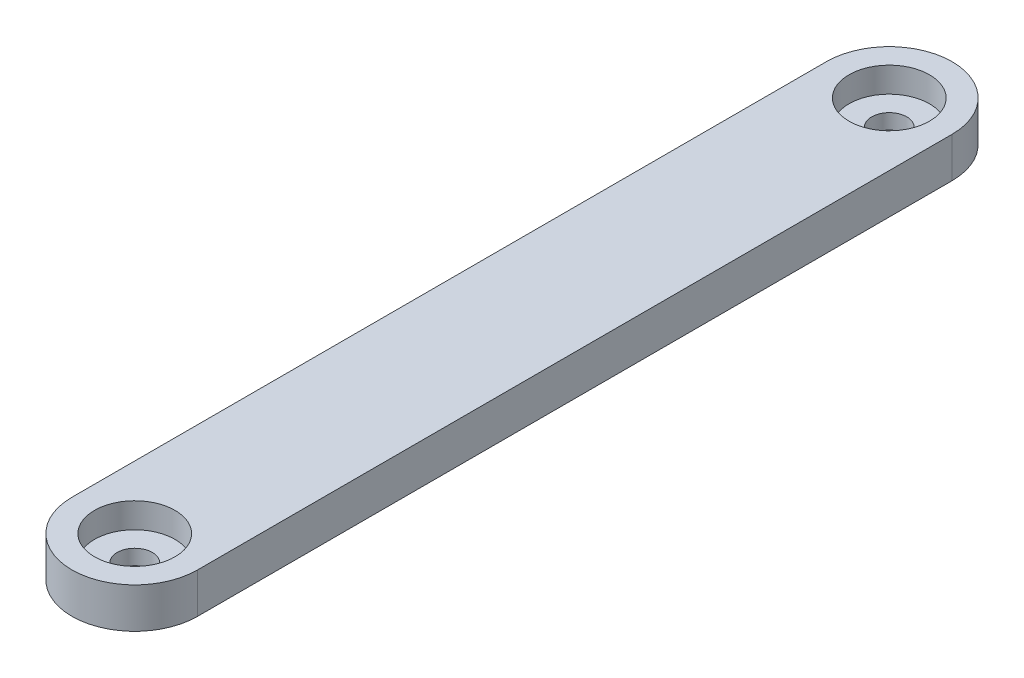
ISO-10303-21;
HEADER;
FILE_DESCRIPTION(('STEP AP214'),'2;1');
FILE_NAME('part.step','',(''),(''),'','','');
FILE_SCHEMA(('AUTOMOTIVE_DESIGN { 1 0 10303 214 1 1 1 1 }'));
ENDSEC;
DATA;
#1=APPLICATION_CONTEXT('core data for automotive mechanical design processes');
#2=APPLICATION_PROTOCOL_DEFINITION('international standard','automotive_design',2000,#1);
#3=PRODUCT_CONTEXT('',#1,'mechanical');
#4=PRODUCT('Part','Part','',(#3));
#5=PRODUCT_RELATED_PRODUCT_CATEGORY('part','',(#4));
#6=PRODUCT_DEFINITION_FORMATION('','',#4);
#7=PRODUCT_DEFINITION_CONTEXT('part definition',#1,'design');
#8=PRODUCT_DEFINITION('design','',#6,#7);
#9=PRODUCT_DEFINITION_SHAPE('','',#8);
#10=(LENGTH_UNIT() NAMED_UNIT(*) SI_UNIT(.MILLI.,.METRE.));
#11=(NAMED_UNIT(*) PLANE_ANGLE_UNIT() SI_UNIT($,.RADIAN.));
#12=(NAMED_UNIT(*) SI_UNIT($,.STERADIAN.) SOLID_ANGLE_UNIT());
#13=UNCERTAINTY_MEASURE_WITH_UNIT(LENGTH_MEASURE(1.E-05),#10,'distance_accuracy_value','');
#14=(GEOMETRIC_REPRESENTATION_CONTEXT(3) GLOBAL_UNCERTAINTY_ASSIGNED_CONTEXT((#13)) GLOBAL_UNIT_ASSIGNED_CONTEXT((#10,
#11,#12)) REPRESENTATION_CONTEXT('',''));
#15=CARTESIAN_POINT('',(0.,0.,0.));
#16=DIRECTION('',(0.,0.,1.));
#17=DIRECTION('',(1.,0.,0.));
#18=AXIS2_PLACEMENT_3D('',#15,#16,#17);
#19=CARTESIAN_POINT('',(0.,8.,0.));
#20=DIRECTION('',(0.,-1.,0.));
#21=DIRECTION('',(0.,0.,-1.));
#22=AXIS2_PLACEMENT_3D('',#19,#20,#21);
#23=CYLINDRICAL_SURFACE('',#22,12.5);
#24=CARTESIAN_POINT('',(0.,0.,0.));
#25=DIRECTION('',(0.,1.,0.));
#26=DIRECTION('',(0.,0.,1.));
#27=AXIS2_PLACEMENT_3D('',#24,#25,#26);
#28=CIRCLE('',#27,12.5);
#29=CARTESIAN_POINT('',(12.5,0.,0.));
#30=VERTEX_POINT('',#29);
#31=CARTESIAN_POINT('',(-12.5,0.,0.));
#32=VERTEX_POINT('',#31);
#33=EDGE_CURVE('E112',#30,#32,#28,.T.);
#34=ORIENTED_EDGE('',*,*,#33,.T.);
#35=DIRECTION('',(0.,-1.,0.));
#36=VECTOR('',#35,1.);
#37=CARTESIAN_POINT('',(-12.5,8.,0.));
#38=LINE('',#37,#36);
#39=CARTESIAN_POINT('',(-12.5,8.,0.));
#40=VERTEX_POINT('',#39);
#41=EDGE_CURVE('E11',#40,#32,#38,.T.);
#42=ORIENTED_EDGE('',*,*,#41,.F.);
#43=CARTESIAN_POINT('',(0.,8.,0.));
#44=DIRECTION('',(0.,1.,0.));
#45=DIRECTION('',(0.,0.,1.));
#46=AXIS2_PLACEMENT_3D('',#43,#44,#45);
#47=CIRCLE('',#46,12.5);
#48=CARTESIAN_POINT('',(12.5,8.,0.));
#49=VERTEX_POINT('',#48);
#50=EDGE_CURVE('E95',#49,#40,#47,.T.);
#51=ORIENTED_EDGE('',*,*,#50,.F.);
#52=DIRECTION('',(0.,-1.,0.));
#53=VECTOR('',#52,1.);
#54=CARTESIAN_POINT('',(12.5,8.,0.));
#55=LINE('',#54,#53);
#56=EDGE_CURVE('E108',#49,#30,#55,.T.);
#57=ORIENTED_EDGE('',*,*,#56,.T.);
#58=EDGE_LOOP('',(#34,#42,#51,#57));
#59=FACE_BOUND('',#58,.T.);
#60=ADVANCED_FACE('F41',(#59),#23,.T.);
#61=CARTESIAN_POINT('',(-12.5,8.,0.));
#62=DIRECTION('',(1.,0.,0.));
#63=DIRECTION('',(0.,0.,-1.));
#64=AXIS2_PLACEMENT_3D('',#61,#62,#63);
#65=PLANE('',#64);
#66=DIRECTION('',(0.,0.,1.));
#67=VECTOR('',#66,1.);
#68=CARTESIAN_POINT('',(-12.5,0.,0.));
#69=LINE('',#68,#67);
#70=CARTESIAN_POINT('',(-12.5,0.,150.));
#71=VERTEX_POINT('',#70);
#72=EDGE_CURVE('E100',#32,#71,#69,.T.);
#73=ORIENTED_EDGE('',*,*,#72,.T.);
#74=DIRECTION('',(0.,-1.,0.));
#75=VECTOR('',#74,1.);
#76=CARTESIAN_POINT('',(-12.5,8.,150.));
#77=LINE('',#76,#75);
#78=CARTESIAN_POINT('',(-12.5,8.,150.));
#79=VERTEX_POINT('',#78);
#80=EDGE_CURVE('E51',#79,#71,#77,.T.);
#81=ORIENTED_EDGE('',*,*,#80,.F.);
#82=DIRECTION('',(0.,0.,1.));
#83=VECTOR('',#82,1.);
#84=CARTESIAN_POINT('',(-12.5,8.,0.));
#85=LINE('',#84,#83);
#86=EDGE_CURVE('E90',#40,#79,#85,.T.);
#87=ORIENTED_EDGE('',*,*,#86,.F.);
#88=ORIENTED_EDGE('',*,*,#41,.T.);
#89=EDGE_LOOP('',(#73,#81,#87,#88));
#90=FACE_BOUND('',#89,.T.);
#91=ADVANCED_FACE('F99',(#90),#65,.F.);
#92=CARTESIAN_POINT('',(0.,8.,150.));
#93=DIRECTION('',(0.,-1.,0.));
#94=DIRECTION('',(0.,0.,-1.));
#95=AXIS2_PLACEMENT_3D('',#92,#93,#94);
#96=CYLINDRICAL_SURFACE('',#95,12.5);
#97=CARTESIAN_POINT('',(0.,0.,150.));
#98=DIRECTION('',(0.,1.,0.));
#99=DIRECTION('',(0.,0.,1.));
#100=AXIS2_PLACEMENT_3D('',#97,#98,#99);
#101=CIRCLE('',#100,12.5);
#102=CARTESIAN_POINT('',(12.5,0.,150.));
#103=VERTEX_POINT('',#102);
#104=EDGE_CURVE('E77',#71,#103,#101,.T.);
#105=ORIENTED_EDGE('',*,*,#104,.T.);
#106=DIRECTION('',(0.,-1.,0.));
#107=VECTOR('',#106,1.);
#108=CARTESIAN_POINT('',(12.5,8.,150.));
#109=LINE('',#108,#107);
#110=CARTESIAN_POINT('',(12.5,8.,150.));
#111=VERTEX_POINT('',#110);
#112=EDGE_CURVE('E102',#111,#103,#109,.T.);
#113=ORIENTED_EDGE('',*,*,#112,.F.);
#114=CARTESIAN_POINT('',(0.,8.,150.));
#115=DIRECTION('',(0.,1.,0.));
#116=DIRECTION('',(0.,0.,1.));
#117=AXIS2_PLACEMENT_3D('',#114,#115,#116);
#118=CIRCLE('',#117,12.5);
#119=EDGE_CURVE('E93',#79,#111,#118,.T.);
#120=ORIENTED_EDGE('',*,*,#119,.F.);
#121=ORIENTED_EDGE('',*,*,#80,.T.);
#122=EDGE_LOOP('',(#105,#113,#120,#121));
#123=FACE_BOUND('',#122,.T.);
#124=ADVANCED_FACE('F104',(#123),#96,.T.);
#125=CARTESIAN_POINT('',(12.5,8.,0.));
#126=DIRECTION('',(-1.,0.,0.));
#127=DIRECTION('',(0.,0.,1.));
#128=AXIS2_PLACEMENT_3D('',#125,#126,#127);
#129=PLANE('',#128);
#130=DIRECTION('',(0.,0.,-1.));
#131=VECTOR('',#130,1.);
#132=CARTESIAN_POINT('',(12.5,0.,0.));
#133=LINE('',#132,#131);
#134=EDGE_CURVE('E83',#103,#30,#133,.T.);
#135=ORIENTED_EDGE('',*,*,#134,.T.);
#136=ORIENTED_EDGE('',*,*,#56,.F.);
#137=DIRECTION('',(0.,0.,-1.));
#138=VECTOR('',#137,1.);
#139=CARTESIAN_POINT('',(12.5,8.,0.));
#140=LINE('',#139,#138);
#141=EDGE_CURVE('E60',#111,#49,#140,.T.);
#142=ORIENTED_EDGE('',*,*,#141,.F.);
#143=ORIENTED_EDGE('',*,*,#112,.T.);
#144=EDGE_LOOP('',(#135,#136,#142,#143));
#145=FACE_BOUND('',#144,.T.);
#146=ADVANCED_FACE('F163',(#145),#129,.F.);
#147=CARTESIAN_POINT('',(0.,8.,0.));
#148=DIRECTION('',(0.,1.,0.));
#149=DIRECTION('',(0.,0.,1.));
#150=AXIS2_PLACEMENT_3D('',#147,#148,#149);
#151=PLANE('',#150);
#152=CARTESIAN_POINT('',(0.,8.,150.));
#153=DIRECTION('',(0.,1.,0.));
#154=DIRECTION('',(0.,0.,1.));
#155=AXIS2_PLACEMENT_3D('',#152,#153,#154);
#156=CIRCLE('',#155,8.);
#157=CARTESIAN_POINT('',(0.,8.,158.));
#158=VERTEX_POINT('',#157);
#159=EDGE_CURVE('E144',#158,#158,#156,.T.);
#160=ORIENTED_EDGE('',*,*,#159,.F.);
#161=EDGE_LOOP('',(#160));
#162=FACE_BOUND('',#161,.T.);
#163=CARTESIAN_POINT('',(0.,8.,0.));
#164=DIRECTION('',(0.,1.,0.));
#165=DIRECTION('',(0.,0.,1.));
#166=AXIS2_PLACEMENT_3D('',#163,#164,#165);
#167=CIRCLE('',#166,8.);
#168=CARTESIAN_POINT('',(0.,8.,8.));
#169=VERTEX_POINT('',#168);
#170=EDGE_CURVE('E129',#169,#169,#167,.T.);
#171=ORIENTED_EDGE('',*,*,#170,.F.);
#172=EDGE_LOOP('',(#171));
#173=FACE_BOUND('',#172,.T.);
#174=ORIENTED_EDGE('',*,*,#50,.T.);
#175=ORIENTED_EDGE('',*,*,#86,.T.);
#176=ORIENTED_EDGE('',*,*,#119,.T.);
#177=ORIENTED_EDGE('',*,*,#141,.T.);
#178=EDGE_LOOP('',(#174,#175,#176,#177));
#179=FACE_BOUND('',#178,.T.);
#180=ADVANCED_FACE('F91',(#162,#173,#179),#151,.T.);
#181=CARTESIAN_POINT('',(0.,0.,0.));
#182=DIRECTION('',(0.,1.,0.));
#183=DIRECTION('',(0.,0.,1.));
#184=AXIS2_PLACEMENT_3D('',#181,#182,#183);
#185=PLANE('',#184);
#186=CARTESIAN_POINT('',(0.,0.,150.));
#187=DIRECTION('',(0.,1.,0.));
#188=DIRECTION('',(0.,0.,1.));
#189=AXIS2_PLACEMENT_3D('',#186,#187,#188);
#190=CIRCLE('',#189,3.5);
#191=CARTESIAN_POINT('',(0.,0.,153.5));
#192=VERTEX_POINT('',#191);
#193=EDGE_CURVE('E264',#192,#192,#190,.T.);
#194=ORIENTED_EDGE('',*,*,#193,.T.);
#195=EDGE_LOOP('',(#194));
#196=FACE_BOUND('',#195,.T.);
#197=CARTESIAN_POINT('',(0.,0.,0.));
#198=DIRECTION('',(0.,1.,0.));
#199=DIRECTION('',(0.,0.,1.));
#200=AXIS2_PLACEMENT_3D('',#197,#198,#199);
#201=CIRCLE('',#200,3.5);
#202=CARTESIAN_POINT('',(0.,0.,3.5));
#203=VERTEX_POINT('',#202);
#204=EDGE_CURVE('E130',#203,#203,#201,.T.);
#205=ORIENTED_EDGE('',*,*,#204,.T.);
#206=EDGE_LOOP('',(#205));
#207=FACE_BOUND('',#206,.T.);
#208=ORIENTED_EDGE('',*,*,#33,.F.);
#209=ORIENTED_EDGE('',*,*,#134,.F.);
#210=ORIENTED_EDGE('',*,*,#104,.F.);
#211=ORIENTED_EDGE('',*,*,#72,.F.);
#212=EDGE_LOOP('',(#208,#209,#210,#211));
#213=FACE_BOUND('',#212,.T.);
#214=ADVANCED_FACE('F158',(#196,#207,#213),#185,.F.);
#215=CARTESIAN_POINT('',(0.,3.,0.));
#216=DIRECTION('',(0.,1.,0.));
#217=DIRECTION('',(0.,0.,1.));
#218=AXIS2_PLACEMENT_3D('',#215,#216,#217);
#219=CYLINDRICAL_SURFACE('',#218,8.);
#220=CARTESIAN_POINT('',(0.,3.,0.));
#221=DIRECTION('',(0.,1.,0.));
#222=DIRECTION('',(0.,0.,1.));
#223=AXIS2_PLACEMENT_3D('',#220,#221,#222);
#224=CIRCLE('',#223,8.);
#225=CARTESIAN_POINT('',(0.,3.,8.));
#226=VERTEX_POINT('',#225);
#227=EDGE_CURVE('E116',#226,#226,#224,.T.);
#228=ORIENTED_EDGE('',*,*,#227,.F.);
#229=EDGE_LOOP('',(#228));
#230=FACE_BOUND('',#229,.T.);
#231=ORIENTED_EDGE('',*,*,#170,.T.);
#232=EDGE_LOOP('',(#231));
#233=FACE_BOUND('',#232,.T.);
#234=ADVANCED_FACE('F155',(#230,#233),#219,.F.);
#235=CARTESIAN_POINT('',(0.,3.,0.));
#236=DIRECTION('',(0.,1.,0.));
#237=DIRECTION('',(0.,0.,1.));
#238=AXIS2_PLACEMENT_3D('',#235,#236,#237);
#239=PLANE('',#238);
#240=CARTESIAN_POINT('',(0.,3.,0.));
#241=DIRECTION('',(0.,1.,0.));
#242=DIRECTION('',(0.,0.,1.));
#243=AXIS2_PLACEMENT_3D('',#240,#241,#242);
#244=CIRCLE('',#243,3.5);
#245=CARTESIAN_POINT('',(0.,3.,3.5));
#246=VERTEX_POINT('',#245);
#247=EDGE_CURVE('E126',#246,#246,#244,.T.);
#248=ORIENTED_EDGE('',*,*,#247,.F.);
#249=EDGE_LOOP('',(#248));
#250=FACE_BOUND('',#249,.T.);
#251=ORIENTED_EDGE('',*,*,#227,.T.);
#252=EDGE_LOOP('',(#251));
#253=FACE_BOUND('',#252,.T.);
#254=ADVANCED_FACE('F153',(#250,#253),#239,.T.);
#255=CARTESIAN_POINT('',(0.,0.,0.));
#256=DIRECTION('',(0.,1.,0.));
#257=DIRECTION('',(0.,0.,1.));
#258=AXIS2_PLACEMENT_3D('',#255,#256,#257);
#259=CYLINDRICAL_SURFACE('',#258,3.5);
#260=ORIENTED_EDGE('',*,*,#247,.T.);
#261=EDGE_LOOP('',(#260));
#262=FACE_BOUND('',#261,.T.);
#263=ORIENTED_EDGE('',*,*,#204,.F.);
#264=EDGE_LOOP('',(#263));
#265=FACE_BOUND('',#264,.T.);
#266=ADVANCED_FACE('F208',(#262,#265),#259,.F.);
#267=CARTESIAN_POINT('',(0.,3.,150.));
#268=DIRECTION('',(0.,1.,0.));
#269=DIRECTION('',(0.,0.,1.));
#270=AXIS2_PLACEMENT_3D('',#267,#268,#269);
#271=CYLINDRICAL_SURFACE('',#270,8.);
#272=CARTESIAN_POINT('',(0.,3.,150.));
#273=DIRECTION('',(0.,1.,0.));
#274=DIRECTION('',(0.,0.,1.));
#275=AXIS2_PLACEMENT_3D('',#272,#273,#274);
#276=CIRCLE('',#275,8.);
#277=CARTESIAN_POINT('',(0.,3.,158.));
#278=VERTEX_POINT('',#277);
#279=EDGE_CURVE('E138',#278,#278,#276,.T.);
#280=ORIENTED_EDGE('',*,*,#279,.F.);
#281=EDGE_LOOP('',(#280));
#282=FACE_BOUND('',#281,.T.);
#283=ORIENTED_EDGE('',*,*,#159,.T.);
#284=EDGE_LOOP('',(#283));
#285=FACE_BOUND('',#284,.T.);
#286=ADVANCED_FACE('F217',(#282,#285),#271,.F.);
#287=CARTESIAN_POINT('',(0.,3.,150.));
#288=DIRECTION('',(0.,1.,0.));
#289=DIRECTION('',(0.,0.,1.));
#290=AXIS2_PLACEMENT_3D('',#287,#288,#289);
#291=PLANE('',#290);
#292=CARTESIAN_POINT('',(0.,3.,150.));
#293=DIRECTION('',(0.,1.,0.));
#294=DIRECTION('',(0.,0.,1.));
#295=AXIS2_PLACEMENT_3D('',#292,#293,#294);
#296=CIRCLE('',#295,3.5);
#297=CARTESIAN_POINT('',(0.,3.,153.5));
#298=VERTEX_POINT('',#297);
#299=EDGE_CURVE('E44',#298,#298,#296,.T.);
#300=ORIENTED_EDGE('',*,*,#299,.F.);
#301=EDGE_LOOP('',(#300));
#302=FACE_BOUND('',#301,.T.);
#303=ORIENTED_EDGE('',*,*,#279,.T.);
#304=EDGE_LOOP('',(#303));
#305=FACE_BOUND('',#304,.T.);
#306=ADVANCED_FACE('F230',(#302,#305),#291,.T.);
#307=CARTESIAN_POINT('',(0.,0.,150.));
#308=DIRECTION('',(0.,1.,0.));
#309=DIRECTION('',(0.,0.,1.));
#310=AXIS2_PLACEMENT_3D('',#307,#308,#309);
#311=CYLINDRICAL_SURFACE('',#310,3.5);
#312=ORIENTED_EDGE('',*,*,#299,.T.);
#313=EDGE_LOOP('',(#312));
#314=FACE_BOUND('',#313,.T.);
#315=ORIENTED_EDGE('',*,*,#193,.F.);
#316=EDGE_LOOP('',(#315));
#317=FACE_BOUND('',#316,.T.);
#318=ADVANCED_FACE('F245',(#314,#317),#311,.F.);
#319=CLOSED_SHELL('',(#60,#91,#124,#146,#180,#214,#234,#254,#266,#286,#306,#318));
#320=MANIFOLD_SOLID_BREP('B2',#319);
#321=ADVANCED_BREP_SHAPE_REPRESENTATION('',(#18,#320),#14);
#322=SHAPE_DEFINITION_REPRESENTATION(#9,#321);
ENDSEC;
END-ISO-10303-21;
